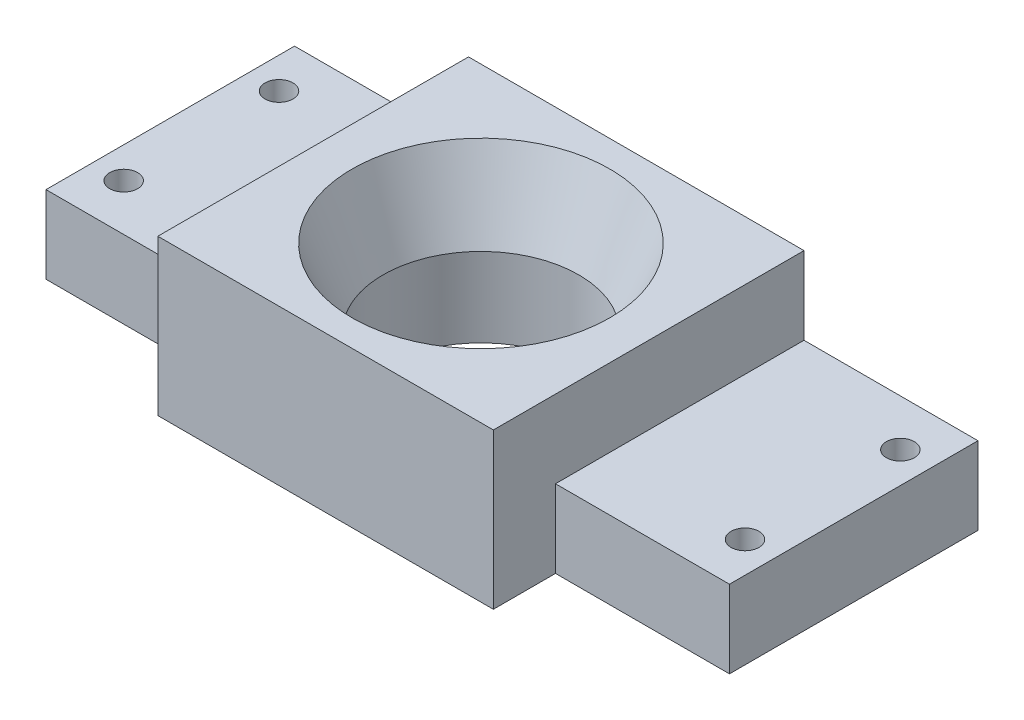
ISO-10303-21;
HEADER;
FILE_DESCRIPTION(('STEP AP214'),'2;1');
FILE_NAME('part.step','',(''),(''),'','','');
FILE_SCHEMA(('AUTOMOTIVE_DESIGN { 1 0 10303 214 1 1 1 1 }'));
ENDSEC;
DATA;
#1=APPLICATION_CONTEXT('core data for automotive mechanical design processes');
#2=APPLICATION_PROTOCOL_DEFINITION('international standard','automotive_design',2000,#1);
#3=PRODUCT_CONTEXT('',#1,'mechanical');
#4=PRODUCT('Part','Part','',(#3));
#5=PRODUCT_RELATED_PRODUCT_CATEGORY('part','',(#4));
#6=PRODUCT_DEFINITION_FORMATION('','',#4);
#7=PRODUCT_DEFINITION_CONTEXT('part definition',#1,'design');
#8=PRODUCT_DEFINITION('design','',#6,#7);
#9=PRODUCT_DEFINITION_SHAPE('','',#8);
#10=(LENGTH_UNIT() NAMED_UNIT(*) SI_UNIT(.MILLI.,.METRE.));
#11=(NAMED_UNIT(*) PLANE_ANGLE_UNIT() SI_UNIT($,.RADIAN.));
#12=(NAMED_UNIT(*) SI_UNIT($,.STERADIAN.) SOLID_ANGLE_UNIT());
#13=UNCERTAINTY_MEASURE_WITH_UNIT(LENGTH_MEASURE(1.E-05),#10,'distance_accuracy_value','');
#14=(GEOMETRIC_REPRESENTATION_CONTEXT(3) GLOBAL_UNCERTAINTY_ASSIGNED_CONTEXT((#13)) GLOBAL_UNIT_ASSIGNED_CONTEXT((#10,
#11,#12)) REPRESENTATION_CONTEXT('',''));
#15=CARTESIAN_POINT('',(0.,0.,0.));
#16=DIRECTION('',(0.,0.,1.));
#17=DIRECTION('',(1.,0.,0.));
#18=AXIS2_PLACEMENT_3D('',#15,#16,#17);
#19=CARTESIAN_POINT('',(108.,100.,100.));
#20=DIRECTION('',(-1.,0.,0.));
#21=DIRECTION('',(0.,0.,1.));
#22=AXIS2_PLACEMENT_3D('',#19,#20,#21);
#23=PLANE('',#22);
#24=DIRECTION('',(0.,-1.,0.));
#25=VECTOR('',#24,1.);
#26=CARTESIAN_POINT('',(108.,50.,60.));
#27=LINE('',#26,#25);
#28=CARTESIAN_POINT('',(108.,50.,60.));
#29=VERTEX_POINT('',#28);
#30=CARTESIAN_POINT('',(108.,0.,60.));
#31=VERTEX_POINT('',#30);
#32=EDGE_CURVE('E127',#29,#31,#27,.T.);
#33=ORIENTED_EDGE('',*,*,#32,.F.);
#34=DIRECTION('',(0.,0.,-1.));
#35=VECTOR('',#34,1.);
#36=CARTESIAN_POINT('',(108.,50.,-100.));
#37=LINE('',#36,#35);
#38=CARTESIAN_POINT('',(108.,50.,-100.));
#39=VERTEX_POINT('',#38);
#40=EDGE_CURVE('E113',#29,#39,#37,.T.);
#41=ORIENTED_EDGE('',*,*,#40,.T.);
#42=DIRECTION('',(0.,-1.,0.));
#43=VECTOR('',#42,1.);
#44=CARTESIAN_POINT('',(108.,100.,-100.));
#45=LINE('',#44,#43);
#46=CARTESIAN_POINT('',(108.,100.,-100.));
#47=VERTEX_POINT('',#46);
#48=EDGE_CURVE('E200',#47,#39,#45,.T.);
#49=ORIENTED_EDGE('',*,*,#48,.F.);
#50=DIRECTION('',(0.,0.,-1.));
#51=VECTOR('',#50,1.);
#52=CARTESIAN_POINT('',(108.,100.,100.));
#53=LINE('',#52,#51);
#54=CARTESIAN_POINT('',(108.,100.,100.));
#55=VERTEX_POINT('',#54);
#56=EDGE_CURVE('E188',#55,#47,#53,.T.);
#57=ORIENTED_EDGE('',*,*,#56,.F.);
#58=DIRECTION('',(0.,-1.,0.));
#59=VECTOR('',#58,1.);
#60=CARTESIAN_POINT('',(108.,100.,100.));
#61=LINE('',#60,#59);
#62=CARTESIAN_POINT('',(108.,0.,100.));
#63=VERTEX_POINT('',#62);
#64=EDGE_CURVE('E43',#55,#63,#61,.T.);
#65=ORIENTED_EDGE('',*,*,#64,.T.);
#66=DIRECTION('',(0.,0.,-1.));
#67=VECTOR('',#66,1.);
#68=CARTESIAN_POINT('',(108.,0.,100.));
#69=LINE('',#68,#67);
#70=EDGE_CURVE('E135',#63,#31,#69,.T.);
#71=ORIENTED_EDGE('',*,*,#70,.T.);
#72=EDGE_LOOP('',(#33,#41,#49,#57,#65,#71));
#73=FACE_BOUND('',#72,.T.);
#74=ADVANCED_FACE('F35',(#73),#23,.F.);
#75=CARTESIAN_POINT('',(-108.,100.,100.));
#76=DIRECTION('',(1.,0.,0.));
#77=DIRECTION('',(0.,0.,-1.));
#78=AXIS2_PLACEMENT_3D('',#75,#76,#77);
#79=PLANE('',#78);
#80=DIRECTION('',(0.,0.,-1.));
#81=VECTOR('',#80,1.);
#82=CARTESIAN_POINT('',(-108.,50.,-100.));
#83=LINE('',#82,#81);
#84=CARTESIAN_POINT('',(-108.,50.,60.));
#85=VERTEX_POINT('',#84);
#86=CARTESIAN_POINT('',(-108.,50.,-100.));
#87=VERTEX_POINT('',#86);
#88=EDGE_CURVE('E154',#85,#87,#83,.T.);
#89=ORIENTED_EDGE('',*,*,#88,.F.);
#90=DIRECTION('',(0.,-1.,0.));
#91=VECTOR('',#90,1.);
#92=CARTESIAN_POINT('',(-108.,50.,60.));
#93=LINE('',#92,#91);
#94=CARTESIAN_POINT('',(-108.,0.,60.));
#95=VERTEX_POINT('',#94);
#96=EDGE_CURVE('E163',#85,#95,#93,.T.);
#97=ORIENTED_EDGE('',*,*,#96,.T.);
#98=DIRECTION('',(0.,0.,1.));
#99=VECTOR('',#98,1.);
#100=CARTESIAN_POINT('',(-108.,0.,100.));
#101=LINE('',#100,#99);
#102=CARTESIAN_POINT('',(-108.,0.,100.));
#103=VERTEX_POINT('',#102);
#104=EDGE_CURVE('E181',#95,#103,#101,.T.);
#105=ORIENTED_EDGE('',*,*,#104,.T.);
#106=DIRECTION('',(0.,-1.,0.));
#107=VECTOR('',#106,1.);
#108=CARTESIAN_POINT('',(-108.,100.,100.));
#109=LINE('',#108,#107);
#110=CARTESIAN_POINT('',(-108.,100.,100.));
#111=VERTEX_POINT('',#110);
#112=EDGE_CURVE('E11',#111,#103,#109,.T.);
#113=ORIENTED_EDGE('',*,*,#112,.F.);
#114=DIRECTION('',(0.,0.,1.));
#115=VECTOR('',#114,1.);
#116=CARTESIAN_POINT('',(-108.,100.,100.));
#117=LINE('',#116,#115);
#118=CARTESIAN_POINT('',(-108.,100.,-100.));
#119=VERTEX_POINT('',#118);
#120=EDGE_CURVE('E182',#119,#111,#117,.T.);
#121=ORIENTED_EDGE('',*,*,#120,.F.);
#122=DIRECTION('',(0.,-1.,0.));
#123=VECTOR('',#122,1.);
#124=CARTESIAN_POINT('',(-108.,100.,-100.));
#125=LINE('',#124,#123);
#126=EDGE_CURVE('E192',#119,#87,#125,.T.);
#127=ORIENTED_EDGE('',*,*,#126,.T.);
#128=EDGE_LOOP('',(#89,#97,#105,#113,#121,#127));
#129=FACE_BOUND('',#128,.T.);
#130=ADVANCED_FACE('F37',(#129),#79,.F.);
#131=CARTESIAN_POINT('',(-108.,100.,100.));
#132=DIRECTION('',(0.,0.,-1.));
#133=DIRECTION('',(-1.,0.,0.));
#134=AXIS2_PLACEMENT_3D('',#131,#132,#133);
#135=PLANE('',#134);
#136=DIRECTION('',(1.,0.,0.));
#137=VECTOR('',#136,1.);
#138=CARTESIAN_POINT('',(-108.,0.,100.));
#139=LINE('',#138,#137);
#140=EDGE_CURVE('E194',#103,#63,#139,.T.);
#141=ORIENTED_EDGE('',*,*,#140,.T.);
#142=ORIENTED_EDGE('',*,*,#64,.F.);
#143=DIRECTION('',(1.,0.,0.));
#144=VECTOR('',#143,1.);
#145=CARTESIAN_POINT('',(-108.,100.,100.));
#146=LINE('',#145,#144);
#147=EDGE_CURVE('E185',#111,#55,#146,.T.);
#148=ORIENTED_EDGE('',*,*,#147,.F.);
#149=ORIENTED_EDGE('',*,*,#112,.T.);
#150=EDGE_LOOP('',(#141,#142,#148,#149));
#151=FACE_BOUND('',#150,.T.);
#152=ADVANCED_FACE('F264',(#151),#135,.F.);
#153=CARTESIAN_POINT('',(-108.,100.,-100.));
#154=DIRECTION('',(0.,0.,1.));
#155=DIRECTION('',(1.,0.,0.));
#156=AXIS2_PLACEMENT_3D('',#153,#154,#155);
#157=PLANE('',#156);
#158=DIRECTION('',(-1.,0.,0.));
#159=VECTOR('',#158,1.);
#160=CARTESIAN_POINT('',(-108.,0.,-100.));
#161=LINE('',#160,#159);
#162=CARTESIAN_POINT('',(220.,0.,-100.));
#163=VERTEX_POINT('',#162);
#164=CARTESIAN_POINT('',(-220.,0.,-100.));
#165=VERTEX_POINT('',#164);
#166=EDGE_CURVE('E186',#163,#165,#161,.T.);
#167=ORIENTED_EDGE('',*,*,#166,.T.);
#168=DIRECTION('',(0.,-1.,0.));
#169=VECTOR('',#168,1.);
#170=CARTESIAN_POINT('',(-220.,50.,-100.));
#171=LINE('',#170,#169);
#172=CARTESIAN_POINT('',(-220.,50.,-100.));
#173=VERTEX_POINT('',#172);
#174=EDGE_CURVE('E169',#173,#165,#171,.T.);
#175=ORIENTED_EDGE('',*,*,#174,.F.);
#176=DIRECTION('',(-1.,0.,0.));
#177=VECTOR('',#176,1.);
#178=CARTESIAN_POINT('',(-108.,50.,-100.));
#179=LINE('',#178,#177);
#180=EDGE_CURVE('E157',#87,#173,#179,.T.);
#181=ORIENTED_EDGE('',*,*,#180,.F.);
#182=ORIENTED_EDGE('',*,*,#126,.F.);
#183=DIRECTION('',(-1.,0.,0.));
#184=VECTOR('',#183,1.);
#185=CARTESIAN_POINT('',(-108.,100.,-100.));
#186=LINE('',#185,#184);
#187=EDGE_CURVE('E190',#47,#119,#186,.T.);
#188=ORIENTED_EDGE('',*,*,#187,.F.);
#189=ORIENTED_EDGE('',*,*,#48,.T.);
#190=DIRECTION('',(1.,0.,0.));
#191=VECTOR('',#190,1.);
#192=CARTESIAN_POINT('',(108.,50.,-100.));
#193=LINE('',#192,#191);
#194=CARTESIAN_POINT('',(220.,50.,-100.));
#195=VERTEX_POINT('',#194);
#196=EDGE_CURVE('E50',#39,#195,#193,.T.);
#197=ORIENTED_EDGE('',*,*,#196,.T.);
#198=DIRECTION('',(0.,-1.,0.));
#199=VECTOR('',#198,1.);
#200=CARTESIAN_POINT('',(220.,50.,-100.));
#201=LINE('',#200,#199);
#202=EDGE_CURVE('E141',#195,#163,#201,.T.);
#203=ORIENTED_EDGE('',*,*,#202,.T.);
#204=EDGE_LOOP('',(#167,#175,#181,#182,#188,#189,#197,#203));
#205=FACE_BOUND('',#204,.T.);
#206=ADVANCED_FACE('F267',(#205),#157,.F.);
#207=CARTESIAN_POINT('',(0.,100.,0.));
#208=DIRECTION('',(0.,-1.,0.));
#209=DIRECTION('',(0.,0.,-1.));
#210=AXIS2_PLACEMENT_3D('',#207,#208,#209);
#211=PLANE('',#210);
#212=CARTESIAN_POINT('',(0.,100.,0.));
#213=DIRECTION('',(0.,-1.,0.));
#214=DIRECTION('',(1.,0.,0.));
#215=AXIS2_PLACEMENT_3D('',#212,#213,#214);
#216=CIRCLE('',#215,83.);
#217=CARTESIAN_POINT('',(82.9999999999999,100.,0.));
#218=VERTEX_POINT('',#217);
#219=EDGE_CURVE('E178',#218,#218,#216,.T.);
#220=ORIENTED_EDGE('',*,*,#219,.T.);
#221=EDGE_LOOP('',(#220));
#222=FACE_BOUND('',#221,.T.);
#223=ORIENTED_EDGE('',*,*,#120,.T.);
#224=ORIENTED_EDGE('',*,*,#147,.T.);
#225=ORIENTED_EDGE('',*,*,#56,.T.);
#226=ORIENTED_EDGE('',*,*,#187,.T.);
#227=EDGE_LOOP('',(#223,#224,#225,#226));
#228=FACE_BOUND('',#227,.T.);
#229=ADVANCED_FACE('F245',(#222,#228),#211,.F.);
#230=CARTESIAN_POINT('',(0.,0.,0.));
#231=DIRECTION('',(0.,-1.,0.));
#232=DIRECTION('',(0.,0.,-1.));
#233=AXIS2_PLACEMENT_3D('',#230,#231,#232);
#234=PLANE('',#233);
#235=CARTESIAN_POINT('',(0.,0.,0.));
#236=DIRECTION('',(0.,-1.,0.));
#237=DIRECTION('',(1.,0.,0.));
#238=AXIS2_PLACEMENT_3D('',#235,#236,#237);
#239=CIRCLE('',#238,63.);
#240=CARTESIAN_POINT('',(63.,0.,0.));
#241=VERTEX_POINT('',#240);
#242=EDGE_CURVE('E172',#241,#241,#239,.T.);
#243=ORIENTED_EDGE('',*,*,#242,.F.);
#244=EDGE_LOOP('',(#243));
#245=FACE_BOUND('',#244,.T.);
#246=ORIENTED_EDGE('',*,*,#104,.F.);
#247=DIRECTION('',(1.,0.,0.));
#248=VECTOR('',#247,1.);
#249=CARTESIAN_POINT('',(-108.,0.,60.));
#250=LINE('',#249,#248);
#251=CARTESIAN_POINT('',(-220.,0.,60.));
#252=VERTEX_POINT('',#251);
#253=EDGE_CURVE('E58',#252,#95,#250,.T.);
#254=ORIENTED_EDGE('',*,*,#253,.F.);
#255=DIRECTION('',(0.,0.,1.));
#256=VECTOR('',#255,1.);
#257=CARTESIAN_POINT('',(-220.,0.,-100.));
#258=LINE('',#257,#256);
#259=EDGE_CURVE('E151',#165,#252,#258,.T.);
#260=ORIENTED_EDGE('',*,*,#259,.F.);
#261=ORIENTED_EDGE('',*,*,#166,.F.);
#262=DIRECTION('',(0.,0.,1.));
#263=VECTOR('',#262,1.);
#264=CARTESIAN_POINT('',(220.,0.,-100.));
#265=LINE('',#264,#263);
#266=CARTESIAN_POINT('',(220.,0.,60.));
#267=VERTEX_POINT('',#266);
#268=EDGE_CURVE('E122',#163,#267,#265,.T.);
#269=ORIENTED_EDGE('',*,*,#268,.T.);
#270=DIRECTION('',(-1.,0.,0.));
#271=VECTOR('',#270,1.);
#272=CARTESIAN_POINT('',(108.,0.,60.));
#273=LINE('',#272,#271);
#274=EDGE_CURVE('E210',#267,#31,#273,.T.);
#275=ORIENTED_EDGE('',*,*,#274,.T.);
#276=ORIENTED_EDGE('',*,*,#70,.F.);
#277=ORIENTED_EDGE('',*,*,#140,.F.);
#278=EDGE_LOOP('',(#246,#254,#260,#261,#269,#275,#276,#277));
#279=FACE_BOUND('',#278,.T.);
#280=CARTESIAN_POINT('',(-200.,0.,-70.));
#281=DIRECTION('',(0.,1.,0.));
#282=DIRECTION('',(0.,0.,1.));
#283=AXIS2_PLACEMENT_3D('',#280,#281,#282);
#284=CIRCLE('',#283,9.00000000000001);
#285=CARTESIAN_POINT('',(-200.,0.,-61.));
#286=VERTEX_POINT('',#285);
#287=EDGE_CURVE('E146',#286,#286,#284,.T.);
#288=ORIENTED_EDGE('',*,*,#287,.T.);
#289=EDGE_LOOP('',(#288));
#290=FACE_BOUND('',#289,.T.);
#291=CARTESIAN_POINT('',(-200.,0.,30.));
#292=DIRECTION('',(0.,1.,0.));
#293=DIRECTION('',(0.,0.,1.));
#294=AXIS2_PLACEMENT_3D('',#291,#292,#293);
#295=CIRCLE('',#294,9.00000000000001);
#296=CARTESIAN_POINT('',(-200.,0.,39.));
#297=VERTEX_POINT('',#296);
#298=EDGE_CURVE('E136',#297,#297,#295,.T.);
#299=ORIENTED_EDGE('',*,*,#298,.T.);
#300=EDGE_LOOP('',(#299));
#301=FACE_BOUND('',#300,.T.);
#302=CARTESIAN_POINT('',(200.,0.,30.));
#303=DIRECTION('',(0.,-1.,0.));
#304=DIRECTION('',(0.,0.,1.));
#305=AXIS2_PLACEMENT_3D('',#302,#303,#304);
#306=CIRCLE('',#305,9.00000000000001);
#307=CARTESIAN_POINT('',(200.,0.,39.));
#308=VERTEX_POINT('',#307);
#309=EDGE_CURVE('E227',#308,#308,#306,.T.);
#310=ORIENTED_EDGE('',*,*,#309,.F.);
#311=EDGE_LOOP('',(#310));
#312=FACE_BOUND('',#311,.T.);
#313=CARTESIAN_POINT('',(200.,0.,-70.));
#314=DIRECTION('',(0.,-1.,0.));
#315=DIRECTION('',(0.,0.,1.));
#316=AXIS2_PLACEMENT_3D('',#313,#314,#315);
#317=CIRCLE('',#316,9.00000000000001);
#318=CARTESIAN_POINT('',(200.,0.,-61.));
#319=VERTEX_POINT('',#318);
#320=EDGE_CURVE('E216',#319,#319,#317,.T.);
#321=ORIENTED_EDGE('',*,*,#320,.F.);
#322=EDGE_LOOP('',(#321));
#323=FACE_BOUND('',#322,.T.);
#324=ADVANCED_FACE('F207',(#245,#279,#290,#301,#312,#323),#234,.T.);
#325=CARTESIAN_POINT('',(0.,100.,0.));
#326=DIRECTION('',(0.,1.,0.));
#327=DIRECTION('',(-1.,0.,0.));
#328=AXIS2_PLACEMENT_3D('',#325,#326,#327);
#329=CONICAL_SURFACE('',#328,83.,0.387523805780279);
#330=CARTESIAN_POINT('',(0.,51.,0.));
#331=DIRECTION('',(0.,-1.,0.));
#332=DIRECTION('',(1.,0.,0.));
#333=AXIS2_PLACEMENT_3D('',#330,#331,#332);
#334=CIRCLE('',#333,63.);
#335=CARTESIAN_POINT('',(63.,51.,0.));
#336=VERTEX_POINT('',#335);
#337=EDGE_CURVE('E175',#336,#336,#334,.T.);
#338=ORIENTED_EDGE('',*,*,#337,.T.);
#339=EDGE_LOOP('',(#338));
#340=FACE_BOUND('',#339,.T.);
#341=ORIENTED_EDGE('',*,*,#219,.F.);
#342=EDGE_LOOP('',(#341));
#343=FACE_BOUND('',#342,.T.);
#344=ADVANCED_FACE('F244',(#340,#343),#329,.F.);
#345=CARTESIAN_POINT('',(0.,0.,0.));
#346=DIRECTION('',(0.,-1.,0.));
#347=DIRECTION('',(1.,0.,0.));
#348=AXIS2_PLACEMENT_3D('',#345,#346,#347);
#349=CYLINDRICAL_SURFACE('',#348,63.);
#350=ORIENTED_EDGE('',*,*,#242,.T.);
#351=EDGE_LOOP('',(#350));
#352=FACE_BOUND('',#351,.T.);
#353=ORIENTED_EDGE('',*,*,#337,.F.);
#354=EDGE_LOOP('',(#353));
#355=FACE_BOUND('',#354,.T.);
#356=ADVANCED_FACE('F297',(#352,#355),#349,.F.);
#357=CARTESIAN_POINT('',(0.,50.,0.));
#358=DIRECTION('',(0.,-1.,0.));
#359=DIRECTION('',(0.,0.,-1.));
#360=AXIS2_PLACEMENT_3D('',#357,#358,#359);
#361=PLANE('',#360);
#362=ORIENTED_EDGE('',*,*,#88,.T.);
#363=ORIENTED_EDGE('',*,*,#180,.T.);
#364=DIRECTION('',(0.,0.,1.));
#365=VECTOR('',#364,1.);
#366=CARTESIAN_POINT('',(-220.,50.,-100.));
#367=LINE('',#366,#365);
#368=CARTESIAN_POINT('',(-220.,50.,60.));
#369=VERTEX_POINT('',#368);
#370=EDGE_CURVE('E159',#173,#369,#367,.T.);
#371=ORIENTED_EDGE('',*,*,#370,.T.);
#372=DIRECTION('',(1.,0.,0.));
#373=VECTOR('',#372,1.);
#374=CARTESIAN_POINT('',(-108.,50.,60.));
#375=LINE('',#374,#373);
#376=EDGE_CURVE('E161',#369,#85,#375,.T.);
#377=ORIENTED_EDGE('',*,*,#376,.T.);
#378=EDGE_LOOP('',(#362,#363,#371,#377));
#379=FACE_BOUND('',#378,.T.);
#380=CARTESIAN_POINT('',(-200.,50.,-70.));
#381=DIRECTION('',(0.,1.,0.));
#382=DIRECTION('',(0.,0.,1.));
#383=AXIS2_PLACEMENT_3D('',#380,#381,#382);
#384=CIRCLE('',#383,9.00000000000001);
#385=CARTESIAN_POINT('',(-200.,50.,-61.));
#386=VERTEX_POINT('',#385);
#387=EDGE_CURVE('E148',#386,#386,#384,.T.);
#388=ORIENTED_EDGE('',*,*,#387,.F.);
#389=EDGE_LOOP('',(#388));
#390=FACE_BOUND('',#389,.T.);
#391=CARTESIAN_POINT('',(-200.,50.,30.));
#392=DIRECTION('',(0.,1.,0.));
#393=DIRECTION('',(0.,0.,1.));
#394=AXIS2_PLACEMENT_3D('',#391,#392,#393);
#395=CIRCLE('',#394,9.00000000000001);
#396=CARTESIAN_POINT('',(-200.,50.,39.));
#397=VERTEX_POINT('',#396);
#398=EDGE_CURVE('E139',#397,#397,#395,.T.);
#399=ORIENTED_EDGE('',*,*,#398,.F.);
#400=EDGE_LOOP('',(#399));
#401=FACE_BOUND('',#400,.T.);
#402=ADVANCED_FACE('F284',(#379,#390,#401),#361,.F.);
#403=CARTESIAN_POINT('',(-220.,50.,-100.));
#404=DIRECTION('',(1.,0.,0.));
#405=DIRECTION('',(0.,0.,-1.));
#406=AXIS2_PLACEMENT_3D('',#403,#404,#405);
#407=PLANE('',#406);
#408=ORIENTED_EDGE('',*,*,#259,.T.);
#409=DIRECTION('',(0.,-1.,0.));
#410=VECTOR('',#409,1.);
#411=CARTESIAN_POINT('',(-220.,50.,60.));
#412=LINE('',#411,#410);
#413=EDGE_CURVE('E167',#369,#252,#412,.T.);
#414=ORIENTED_EDGE('',*,*,#413,.F.);
#415=ORIENTED_EDGE('',*,*,#370,.F.);
#416=ORIENTED_EDGE('',*,*,#174,.T.);
#417=EDGE_LOOP('',(#408,#414,#415,#416));
#418=FACE_BOUND('',#417,.T.);
#419=ADVANCED_FACE('F278',(#418),#407,.F.);
#420=CARTESIAN_POINT('',(-108.,50.,60.));
#421=DIRECTION('',(0.,0.,-1.));
#422=DIRECTION('',(-1.,0.,0.));
#423=AXIS2_PLACEMENT_3D('',#420,#421,#422);
#424=PLANE('',#423);
#425=ORIENTED_EDGE('',*,*,#253,.T.);
#426=ORIENTED_EDGE('',*,*,#96,.F.);
#427=ORIENTED_EDGE('',*,*,#376,.F.);
#428=ORIENTED_EDGE('',*,*,#413,.T.);
#429=EDGE_LOOP('',(#425,#426,#427,#428));
#430=FACE_BOUND('',#429,.T.);
#431=ADVANCED_FACE('F282',(#430),#424,.F.);
#432=CARTESIAN_POINT('',(-200.,50.,-70.));
#433=DIRECTION('',(0.,-1.,0.));
#434=DIRECTION('',(0.,0.,-1.));
#435=AXIS2_PLACEMENT_3D('',#432,#433,#434);
#436=CYLINDRICAL_SURFACE('',#435,9.00000000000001);
#437=ORIENTED_EDGE('',*,*,#387,.T.);
#438=EDGE_LOOP('',(#437));
#439=FACE_BOUND('',#438,.T.);
#440=ORIENTED_EDGE('',*,*,#287,.F.);
#441=EDGE_LOOP('',(#440));
#442=FACE_BOUND('',#441,.T.);
#443=ADVANCED_FACE('F306',(#439,#442),#436,.F.);
#444=CARTESIAN_POINT('',(-200.,50.,30.));
#445=DIRECTION('',(0.,-1.,0.));
#446=DIRECTION('',(0.,0.,-1.));
#447=AXIS2_PLACEMENT_3D('',#444,#445,#446);
#448=CYLINDRICAL_SURFACE('',#447,9.00000000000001);
#449=ORIENTED_EDGE('',*,*,#398,.T.);
#450=EDGE_LOOP('',(#449));
#451=FACE_BOUND('',#450,.T.);
#452=ORIENTED_EDGE('',*,*,#298,.F.);
#453=EDGE_LOOP('',(#452));
#454=FACE_BOUND('',#453,.T.);
#455=ADVANCED_FACE('F311',(#451,#454),#448,.F.);
#456=CARTESIAN_POINT('',(108.,50.,60.));
#457=DIRECTION('',(0.,0.,1.));
#458=DIRECTION('',(1.,0.,0.));
#459=AXIS2_PLACEMENT_3D('',#456,#457,#458);
#460=PLANE('',#459);
#461=ORIENTED_EDGE('',*,*,#274,.F.);
#462=DIRECTION('',(0.,-1.,0.));
#463=VECTOR('',#462,1.);
#464=CARTESIAN_POINT('',(220.,50.,60.));
#465=LINE('',#464,#463);
#466=CARTESIAN_POINT('',(220.,50.,60.));
#467=VERTEX_POINT('',#466);
#468=EDGE_CURVE('E129',#467,#267,#465,.T.);
#469=ORIENTED_EDGE('',*,*,#468,.F.);
#470=DIRECTION('',(-1.,0.,0.));
#471=VECTOR('',#470,1.);
#472=CARTESIAN_POINT('',(108.,50.,60.));
#473=LINE('',#472,#471);
#474=EDGE_CURVE('E116',#467,#29,#473,.T.);
#475=ORIENTED_EDGE('',*,*,#474,.T.);
#476=ORIENTED_EDGE('',*,*,#32,.T.);
#477=EDGE_LOOP('',(#461,#469,#475,#476));
#478=FACE_BOUND('',#477,.T.);
#479=ADVANCED_FACE('F126',(#478),#460,.T.);
#480=CARTESIAN_POINT('',(220.,50.,-100.));
#481=DIRECTION('',(1.,0.,0.));
#482=DIRECTION('',(0.,0.,-1.));
#483=AXIS2_PLACEMENT_3D('',#480,#481,#482);
#484=PLANE('',#483);
#485=ORIENTED_EDGE('',*,*,#268,.F.);
#486=ORIENTED_EDGE('',*,*,#202,.F.);
#487=DIRECTION('',(0.,0.,1.));
#488=VECTOR('',#487,1.);
#489=CARTESIAN_POINT('',(220.,50.,-100.));
#490=LINE('',#489,#488);
#491=EDGE_CURVE('E130',#195,#467,#490,.T.);
#492=ORIENTED_EDGE('',*,*,#491,.T.);
#493=ORIENTED_EDGE('',*,*,#468,.T.);
#494=EDGE_LOOP('',(#485,#486,#492,#493));
#495=FACE_BOUND('',#494,.T.);
#496=ADVANCED_FACE('F256',(#495),#484,.T.);
#497=CARTESIAN_POINT('',(0.,50.,0.));
#498=DIRECTION('',(0.,-1.,0.));
#499=DIRECTION('',(0.,0.,-1.));
#500=AXIS2_PLACEMENT_3D('',#497,#498,#499);
#501=PLANE('',#500);
#502=CARTESIAN_POINT('',(200.,50.,30.));
#503=DIRECTION('',(0.,-1.,0.));
#504=DIRECTION('',(0.,0.,1.));
#505=AXIS2_PLACEMENT_3D('',#502,#503,#504);
#506=CIRCLE('',#505,9.00000000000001);
#507=CARTESIAN_POINT('',(200.,50.,39.));
#508=VERTEX_POINT('',#507);
#509=EDGE_CURVE('E225',#508,#508,#506,.T.);
#510=ORIENTED_EDGE('',*,*,#509,.T.);
#511=EDGE_LOOP('',(#510));
#512=FACE_BOUND('',#511,.T.);
#513=CARTESIAN_POINT('',(200.,50.,-70.));
#514=DIRECTION('',(0.,-1.,0.));
#515=DIRECTION('',(0.,0.,1.));
#516=AXIS2_PLACEMENT_3D('',#513,#514,#515);
#517=CIRCLE('',#516,9.00000000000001);
#518=CARTESIAN_POINT('',(200.,50.,-61.));
#519=VERTEX_POINT('',#518);
#520=EDGE_CURVE('E212',#519,#519,#517,.T.);
#521=ORIENTED_EDGE('',*,*,#520,.T.);
#522=EDGE_LOOP('',(#521));
#523=FACE_BOUND('',#522,.T.);
#524=ORIENTED_EDGE('',*,*,#40,.F.);
#525=ORIENTED_EDGE('',*,*,#474,.F.);
#526=ORIENTED_EDGE('',*,*,#491,.F.);
#527=ORIENTED_EDGE('',*,*,#196,.F.);
#528=EDGE_LOOP('',(#524,#525,#526,#527));
#529=FACE_BOUND('',#528,.T.);
#530=ADVANCED_FACE('F115',(#512,#523,#529),#501,.F.);
#531=CARTESIAN_POINT('',(200.,50.,-70.));
#532=DIRECTION('',(0.,-1.,0.));
#533=DIRECTION('',(0.,0.,-1.));
#534=AXIS2_PLACEMENT_3D('',#531,#532,#533);
#535=CYLINDRICAL_SURFACE('',#534,9.00000000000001);
#536=ORIENTED_EDGE('',*,*,#520,.F.);
#537=EDGE_LOOP('',(#536));
#538=FACE_BOUND('',#537,.T.);
#539=ORIENTED_EDGE('',*,*,#320,.T.);
#540=EDGE_LOOP('',(#539));
#541=FACE_BOUND('',#540,.T.);
#542=ADVANCED_FACE('F238',(#538,#541),#535,.F.);
#543=CARTESIAN_POINT('',(200.,50.,30.));
#544=DIRECTION('',(0.,-1.,0.));
#545=DIRECTION('',(0.,0.,-1.));
#546=AXIS2_PLACEMENT_3D('',#543,#544,#545);
#547=CYLINDRICAL_SURFACE('',#546,9.00000000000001);
#548=ORIENTED_EDGE('',*,*,#509,.F.);
#549=EDGE_LOOP('',(#548));
#550=FACE_BOUND('',#549,.T.);
#551=ORIENTED_EDGE('',*,*,#309,.T.);
#552=EDGE_LOOP('',(#551));
#553=FACE_BOUND('',#552,.T.);
#554=ADVANCED_FACE('F235',(#550,#553),#547,.F.);
#555=CLOSED_SHELL('',(#74,#130,#152,#206,#229,#324,#344,#356,#402,#419,#431,#443,#455,#479,#496,
#530,#542,#554));
#556=MANIFOLD_SOLID_BREP('B2',#555);
#557=ADVANCED_BREP_SHAPE_REPRESENTATION('',(#18,#556),#14);
#558=SHAPE_DEFINITION_REPRESENTATION(#9,#557);
ENDSEC;
END-ISO-10303-21;
